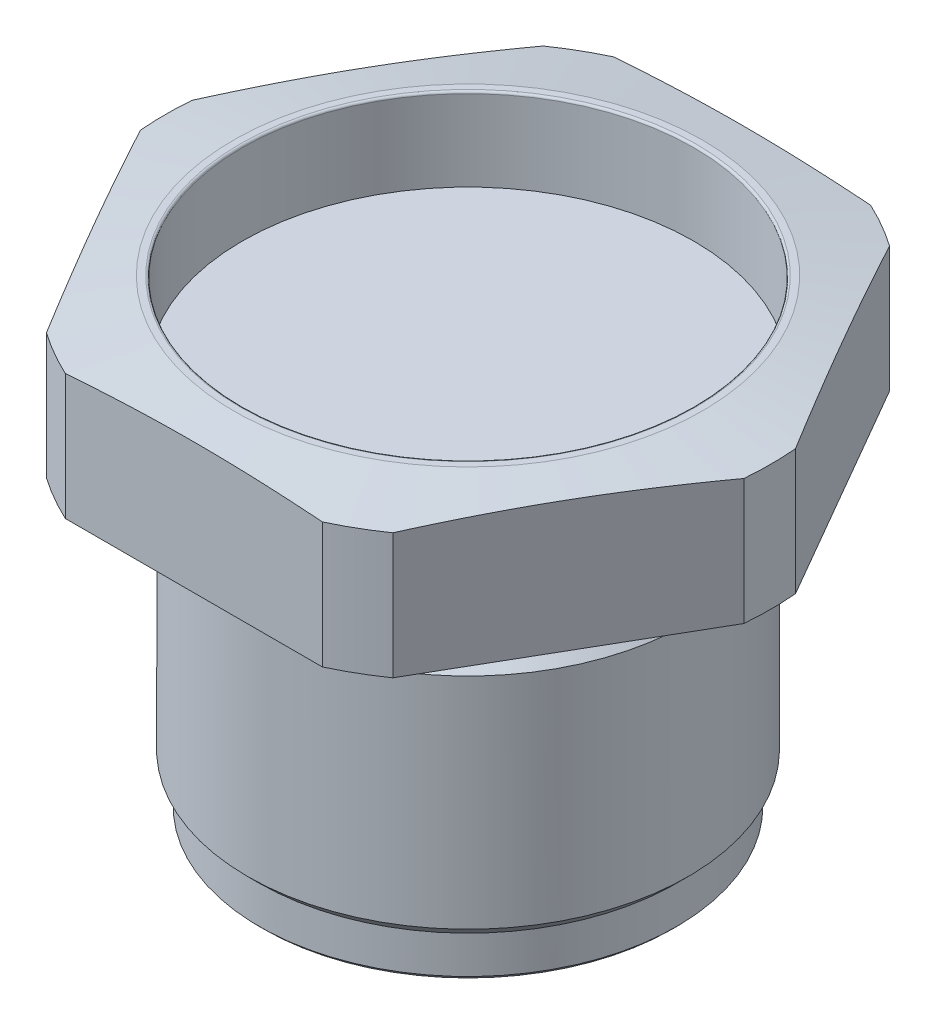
ISO-10303-21;
HEADER;
FILE_DESCRIPTION(('STEP AP214'),'2;1');
FILE_NAME('part.step','',(''),(''),'','','');
FILE_SCHEMA(('AUTOMOTIVE_DESIGN { 1 0 10303 214 1 1 1 1 }'));
ENDSEC;
DATA;
#1=APPLICATION_CONTEXT('core data for automotive mechanical design processes');
#2=APPLICATION_PROTOCOL_DEFINITION('international standard','automotive_design',2000,#1);
#3=PRODUCT_CONTEXT('',#1,'mechanical');
#4=PRODUCT('Part','Part','',(#3));
#5=PRODUCT_RELATED_PRODUCT_CATEGORY('part','',(#4));
#6=PRODUCT_DEFINITION_FORMATION('','',#4);
#7=PRODUCT_DEFINITION_CONTEXT('part definition',#1,'design');
#8=PRODUCT_DEFINITION('design','',#6,#7);
#9=PRODUCT_DEFINITION_SHAPE('','',#8);
#10=(LENGTH_UNIT() NAMED_UNIT(*) SI_UNIT(.MILLI.,.METRE.));
#11=(NAMED_UNIT(*) PLANE_ANGLE_UNIT() SI_UNIT($,.RADIAN.));
#12=(NAMED_UNIT(*) SI_UNIT($,.STERADIAN.) SOLID_ANGLE_UNIT());
#13=UNCERTAINTY_MEASURE_WITH_UNIT(LENGTH_MEASURE(1.E-05),#10,'distance_accuracy_value','');
#14=(GEOMETRIC_REPRESENTATION_CONTEXT(3) GLOBAL_UNCERTAINTY_ASSIGNED_CONTEXT((#13)) GLOBAL_UNIT_ASSIGNED_CONTEXT((#10,
#11,#12)) REPRESENTATION_CONTEXT('',''));
#15=CARTESIAN_POINT('',(0.,0.,0.));
#16=DIRECTION('',(0.,0.,1.));
#17=DIRECTION('',(1.,0.,0.));
#18=AXIS2_PLACEMENT_3D('',#15,#16,#17);
#19=CARTESIAN_POINT('',(24.0500027,-37.6428,0.));
#20=DIRECTION('',(0.,-1.,0.));
#21=DIRECTION('',(0.,0.,-1.));
#22=AXIS2_PLACEMENT_3D('',#19,#20,#21);
#23=PLANE('',#22);
#24=CARTESIAN_POINT('',(0.,-37.6428,0.));
#25=DIRECTION('',(0.,-1.,0.));
#26=DIRECTION('',(0.,0.,-1.));
#27=AXIS2_PLACEMENT_3D('',#24,#25,#26);
#28=CIRCLE('',#27,22.1334044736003);
#29=CARTESIAN_POINT('',(0.,-37.6428,-22.1334044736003));
#30=VERTEX_POINT('',#29);
#31=EDGE_CURVE('E12',#30,#30,#28,.T.);
#32=ORIENTED_EDGE('',*,*,#31,.F.);
#33=EDGE_LOOP('',(#32));
#34=FACE_BOUND('',#33,.T.);
#35=CARTESIAN_POINT('',(0.,-37.6428,0.));
#36=DIRECTION('',(0.,-1.,0.));
#37=DIRECTION('',(0.,0.,-1.));
#38=AXIS2_PLACEMENT_3D('',#35,#36,#37);
#39=CIRCLE('',#38,23.55000494);
#40=CARTESIAN_POINT('',(0.,-37.6428,-23.55000494));
#41=VERTEX_POINT('',#40);
#42=EDGE_CURVE('E184',#41,#41,#39,.T.);
#43=ORIENTED_EDGE('',*,*,#42,.T.);
#44=EDGE_LOOP('',(#43));
#45=FACE_BOUND('',#44,.T.);
#46=ADVANCED_FACE('F35',(#34,#45),#23,.T.);
#47=CARTESIAN_POINT('',(0.,-8.96894233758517,0.));
#48=DIRECTION('',(0.,-1.,0.));
#49=DIRECTION('',(0.,0.,-1.));
#50=AXIS2_PLACEMENT_3D('',#47,#48,#49);
#51=CYLINDRICAL_SURFACE('',#50,24.0500027);
#52=CARTESIAN_POINT('',(0.,-0.508,0.));
#53=DIRECTION('',(0.,-1.,0.));
#54=DIRECTION('',(0.,0.,-1.));
#55=AXIS2_PLACEMENT_3D('',#52,#53,#54);
#56=CIRCLE('',#55,24.0500027);
#57=CARTESIAN_POINT('',(0.,-0.508,-24.0500027));
#58=VERTEX_POINT('',#57);
#59=EDGE_CURVE('E201',#58,#58,#56,.T.);
#60=ORIENTED_EDGE('',*,*,#59,.T.);
#61=EDGE_LOOP('',(#60));
#62=FACE_BOUND('',#61,.T.);
#63=CARTESIAN_POINT('',(0.,-4.826,0.));
#64=DIRECTION('',(0.,-1.,0.));
#65=DIRECTION('',(0.,0.,-1.));
#66=AXIS2_PLACEMENT_3D('',#63,#64,#65);
#67=CIRCLE('',#66,24.0500027);
#68=CARTESIAN_POINT('',(0.,-4.826,-24.0500027));
#69=VERTEX_POINT('',#68);
#70=EDGE_CURVE('E198',#69,#69,#67,.T.);
#71=ORIENTED_EDGE('',*,*,#70,.F.);
#72=EDGE_LOOP('',(#71));
#73=FACE_BOUND('',#72,.T.);
#74=ADVANCED_FACE('F213',(#62,#73),#51,.T.);
#75=CARTESIAN_POINT('',(0.,14.4866013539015,0.));
#76=DIRECTION('',(0.,-1.,0.));
#77=DIRECTION('',(0.,0.,-1.));
#78=AXIS2_PLACEMENT_3D('',#75,#76,#77);
#79=CONICAL_SURFACE('',#78,34.925,1.39626340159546);
#80=CARTESIAN_POINT('',(0.,15.875,0.));
#81=DIRECTION('',(0.,-1.,0.));
#82=DIRECTION('',(0.,0.,-1.));
#83=AXIS2_PLACEMENT_3D('',#80,#81,#82);
#84=CIRCLE('',#83,27.051);
#85=CARTESIAN_POINT('',(0.,15.875,-27.051));
#86=VERTEX_POINT('',#85);
#87=EDGE_CURVE('E160',#86,#86,#84,.T.);
#88=ORIENTED_EDGE('',*,*,#87,.T.);
#89=EDGE_LOOP('',(#88));
#90=FACE_BOUND('',#89,.T.);
#91=CARTESIAN_POINT('',(0.,14.4866013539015,0.));
#92=DIRECTION('',(0.,-1.,0.));
#93=DIRECTION('',(0.,0.,-1.));
#94=AXIS2_PLACEMENT_3D('',#91,#92,#93);
#95=CIRCLE('',#94,34.925);
#96=CARTESIAN_POINT('',(-34.798161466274,14.4866013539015,2.97381633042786));
#97=VERTEX_POINT('',#96);
#98=CARTESIAN_POINT('',(-34.7981614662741,14.4866013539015,-2.97381633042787));
#99=VERTEX_POINT('',#98);
#100=EDGE_CURVE('E378',#97,#99,#95,.T.);
#101=ORIENTED_EDGE('',*,*,#100,.F.);
#102=CARTESIAN_POINT('',(-34.7994975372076,14.4864013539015,2.97150218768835));
#103=CARTESIAN_POINT('',(-34.490945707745,14.5325933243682,3.50592963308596));
#104=CARTESIAN_POINT('',(-34.1823063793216,14.5764325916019,4.04050863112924));
#105=CARTESIAN_POINT('',(-33.5648562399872,14.6590851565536,5.10996364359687));
#106=CARTESIAN_POINT('',(-33.2560454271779,14.6978983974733,5.64483966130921));
#107=CARTESIAN_POINT('',(-32.3293298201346,14.8063216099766,7.24995817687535));
#108=CARTESIAN_POINT('',(-31.7111834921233,14.8679087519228,8.32061902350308));
#109=CARTESIAN_POINT('',(-30.4753697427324,14.9673711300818,10.4611112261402));
#110=CARTESIAN_POINT('',(-29.8577030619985,15.0052829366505,11.5309412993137));
#111=CARTESIAN_POINT('',(-28.6221313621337,15.056013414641,13.6710142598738));
#112=CARTESIAN_POINT('',(-28.0042263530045,15.0688330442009,14.7412571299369));
#113=CARTESIAN_POINT('',(-26.7684163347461,15.0688330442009,16.8817428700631));
#114=CARTESIAN_POINT('',(-26.1505113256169,15.056013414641,17.9519857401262));
#115=CARTESIAN_POINT('',(-24.9149396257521,15.0052829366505,20.0920587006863));
#116=CARTESIAN_POINT('',(-24.2972729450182,14.9673711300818,21.1618887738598));
#117=CARTESIAN_POINT('',(-23.0614591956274,14.8679087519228,23.3023809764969));
#118=CARTESIAN_POINT('',(-22.4433128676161,14.8063216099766,24.3730418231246));
#119=CARTESIAN_POINT('',(-21.5165972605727,14.6978983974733,25.9781603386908));
#120=CARTESIAN_POINT('',(-21.2077864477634,14.6590851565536,26.5130363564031));
#121=CARTESIAN_POINT('',(-20.590336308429,14.5764325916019,27.5824913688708));
#122=CARTESIAN_POINT('',(-20.2816969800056,14.5325933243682,28.117070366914));
#123=CARTESIAN_POINT('',(-19.973145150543,14.4864013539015,28.6514978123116));
#124=B_SPLINE_CURVE_WITH_KNOTS('',3,(#102,#103,#104,#105,#106,#107,#108,#109,#110,#111,#112,
#113,#114,#115,#116,#117,#118,#119,#120,#121,#122,#123),.UNSPECIFIED.,.F.,.F.,(4,2,2,2,2,2,2,2,
2,2,4),(0.,1.85648195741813,3.71298489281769,7.42624125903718,11.1337476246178,14.8411124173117,
18.5484772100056,22.2559835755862,25.9692399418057,27.8257428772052,29.6822248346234),.UNSPECIFIED.);
#125=CARTESIAN_POINT('',(-19.9744812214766,14.4866013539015,28.6491836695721));
#126=VERTEX_POINT('',#125);
#127=EDGE_CURVE('E335',#97,#126,#124,.T.);
#128=ORIENTED_EDGE('',*,*,#127,.T.);
#129=CARTESIAN_POINT('',(-14.8236802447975,14.4866013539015,31.623));
#130=VERTEX_POINT('',#129);
#131=EDGE_CURVE('E178',#130,#126,#95,.T.);
#132=ORIENTED_EDGE('',*,*,#131,.F.);
#133=CARTESIAN_POINT('',(-48.1567000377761,10.4863639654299,31.623));
#134=CARTESIAN_POINT('',(-47.4393926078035,10.5920854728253,31.623));
#135=CARTESIAN_POINT('',(-46.7219832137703,10.6971147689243,31.623));
#136=CARTESIAN_POINT('',(-45.2869404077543,10.9056390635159,31.623));
#137=CARTESIAN_POINT('',(-44.569306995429,11.0091340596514,31.623));
#138=CARTESIAN_POINT('',(-42.4160180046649,11.3170960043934,31.623));
#139=CARTESIAN_POINT('',(-40.9799995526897,11.5190360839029,31.623));
#140=CARTESIAN_POINT('',(-38.1062127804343,11.9147802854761,31.623));
#141=CARTESIAN_POINT('',(-36.6684439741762,12.1085808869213,31.623));
#142=CARTESIAN_POINT('',(-33.7915811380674,12.4860790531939,31.623));
#143=CARTESIAN_POINT('',(-32.3524871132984,12.6697766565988,31.623));
#144=CARTESIAN_POINT('',(-29.4776046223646,13.0241287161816,31.623));
#145=CARTESIAN_POINT('',(-28.0418213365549,13.1948249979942,31.623));
#146=CARTESIAN_POINT('',(-25.168512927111,13.5209937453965,31.623));
#147=CARTESIAN_POINT('',(-23.7309878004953,13.6764661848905,31.623));
#148=CARTESIAN_POINT('',(-20.8541177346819,13.968739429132,31.623));
#149=CARTESIAN_POINT('',(-19.4147729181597,14.1055414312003,31.623));
#150=CARTESIAN_POINT('',(-16.5340924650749,14.3565373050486,31.623));
#151=CARTESIAN_POINT('',(-15.0927568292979,14.4707311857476,31.623));
#152=CARTESIAN_POINT('',(-12.2014034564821,14.6727749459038,31.623));
#153=CARTESIAN_POINT('',(-10.7513767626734,14.760498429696,31.623));
#154=CARTESIAN_POINT('',(-7.84976297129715,14.904850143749,31.623));
#155=CARTESIAN_POINT('',(-6.39817588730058,14.9614786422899,31.623));
#156=CARTESIAN_POINT('',(-3.49431685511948,15.0405951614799,31.623));
#157=CARTESIAN_POINT('',(-2.04204507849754,15.0630893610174,31.623));
#158=CARTESIAN_POINT('',(0.862616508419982,15.0726378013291,31.623));
#159=CARTESIAN_POINT('',(2.31500631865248,15.0596920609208,31.623));
#160=CARTESIAN_POINT('',(5.22133074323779,14.9990802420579,31.623));
#161=CARTESIAN_POINT('',(6.67526419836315,14.9513596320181,31.623));
#162=CARTESIAN_POINT('',(9.58170754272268,14.8237856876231,31.623));
#163=CARTESIAN_POINT('',(11.0342174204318,14.7439320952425,31.623));
#164=CARTESIAN_POINT('',(13.9377497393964,14.5559219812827,31.623));
#165=CARTESIAN_POINT('',(15.3887717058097,14.4477582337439,31.623));
#166=CARTESIAN_POINT('',(18.2888053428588,14.2074244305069,31.623));
#167=CARTESIAN_POINT('',(19.7378170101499,14.0752543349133,31.623));
#168=CARTESIAN_POINT('',(22.5560206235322,13.7986726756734,31.623));
#169=CARTESIAN_POINT('',(23.9253156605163,13.6553012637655,31.623));
#170=CARTESIAN_POINT('',(26.6622944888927,13.3538554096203,31.623));
#171=CARTESIAN_POINT('',(28.029978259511,13.1957807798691,31.623));
#172=CARTESIAN_POINT('',(30.7639552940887,12.8675564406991,31.623));
#173=CARTESIAN_POINT('',(32.1302484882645,12.6974061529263,31.623));
#174=CARTESIAN_POINT('',(34.861555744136,12.3472108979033,31.623));
#175=CARTESIAN_POINT('',(36.2265698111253,12.167165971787,31.623));
#176=CARTESIAN_POINT('',(38.9557031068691,11.7989174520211,31.623));
#177=CARTESIAN_POINT('',(40.3198221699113,11.6107126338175,31.623));
#178=CARTESIAN_POINT('',(43.0471163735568,11.2275913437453,31.623));
#179=CARTESIAN_POINT('',(44.4102915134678,11.0326748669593,31.623));
#180=CARTESIAN_POINT('',(47.1357929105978,10.6372788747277,31.623));
#181=CARTESIAN_POINT('',(48.4981191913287,10.4367995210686,31.623));
#182=CARTESIAN_POINT('',(51.222077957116,10.0311913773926,31.623));
#183=CARTESIAN_POINT('',(52.5837104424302,9.82606258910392,31.623));
#184=CARTESIAN_POINT('',(55.3005625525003,9.4127836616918,31.623));
#185=CARTESIAN_POINT('',(56.6557847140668,9.20465018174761,31.623));
#186=CARTESIAN_POINT('',(59.3657211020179,8.78510037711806,31.623));
#187=CARTESIAN_POINT('',(60.720435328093,8.57368405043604,31.623));
#188=CARTESIAN_POINT('',(64.7839427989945,7.93525909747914,31.623));
#189=CARTESIAN_POINT('',(67.492080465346,7.50407761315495,31.623));
#190=CARTESIAN_POINT('',(72.9053414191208,6.6337902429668,31.623));
#191=CARTESIAN_POINT('',(75.6104655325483,6.19468948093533,31.623));
#192=CARTESIAN_POINT('',(79.6673673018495,5.53137848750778,31.623));
#193=CARTESIAN_POINT('',(81.0195267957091,5.30949990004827,31.623));
#194=CARTESIAN_POINT('',(83.7236190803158,4.86436973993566,31.623));
#195=CARTESIAN_POINT('',(85.0755518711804,4.6411181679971,31.623));
#196=CARTESIAN_POINT('',(86.4273859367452,4.41727067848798,31.623));
#197=B_SPLINE_CURVE_WITH_KNOTS('',3,(#133,#134,#135,#136,#137,#138,#139,#140,#141,#142,#143,
#144,#145,#146,#147,#148,#149,#150,#151,#152,#153,#154,#155,#156,#157,#158,#159,#160,#161,#162,
#163,#164,#165,#166,#167,#168,#169,#170,#171,#172,#173,#174,#175,#176,#177,#178,#179,#180,#181,
#182,#183,#184,#185,#186,#187,#188,#189,#190,#191,#192,#193,#194,#195,#196),.UNSPECIFIED.,.F.,
.F.,(4,2,2,2,2,2,2,2,2,2,2,2,2,2,2,2,2,2,2,2,2,2,2,2,2,2,2,2,2,2,2,4),(0.,2.17516898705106,
4.35034131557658,8.70076445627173,13.0530503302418,17.4053195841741,21.7429377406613,
26.0805633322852,30.4179106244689,34.7552562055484,39.1129962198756,43.4706986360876,
47.8276121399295,52.184523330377,56.5482814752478,60.9120746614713,65.276982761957,
69.6418981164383,73.7721456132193,77.9024457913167,82.032943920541,86.1634248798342,
90.294527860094,94.4256338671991,98.5566198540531,102.687604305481,106.800933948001,
110.914266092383,119.140992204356,127.362574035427,131.473301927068,135.584027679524),.UNSPECIFIED.);
#198=CARTESIAN_POINT('',(14.8236802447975,14.4866013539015,31.623));
#199=VERTEX_POINT('',#198);
#200=EDGE_CURVE('E341',#130,#199,#197,.T.);
#201=ORIENTED_EDGE('',*,*,#200,.T.);
#202=CARTESIAN_POINT('',(19.9744812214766,14.4866013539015,28.6491836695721));
#203=VERTEX_POINT('',#202);
#204=EDGE_CURVE('E381',#203,#199,#95,.T.);
#205=ORIENTED_EDGE('',*,*,#204,.F.);
#206=CARTESIAN_POINT('',(19.973145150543,14.4864013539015,28.6514978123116));
#207=CARTESIAN_POINT('',(20.2816969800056,14.5325933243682,28.117070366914));
#208=CARTESIAN_POINT('',(20.590336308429,14.5764325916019,27.5824913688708));
#209=CARTESIAN_POINT('',(21.2077864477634,14.6590851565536,26.5130363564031));
#210=CARTESIAN_POINT('',(21.5165972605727,14.6978983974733,25.9781603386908));
#211=CARTESIAN_POINT('',(22.4433128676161,14.8063216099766,24.3730418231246));
#212=CARTESIAN_POINT('',(23.0614591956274,14.8679087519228,23.3023809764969));
#213=CARTESIAN_POINT('',(24.2972729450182,14.9673711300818,21.1618887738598));
#214=CARTESIAN_POINT('',(24.9149396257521,15.0052829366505,20.0920587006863));
#215=CARTESIAN_POINT('',(26.1505113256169,15.056013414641,17.9519857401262));
#216=CARTESIAN_POINT('',(26.7684163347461,15.0688330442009,16.8817428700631));
#217=CARTESIAN_POINT('',(28.0042263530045,15.0688330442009,14.7412571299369));
#218=CARTESIAN_POINT('',(28.6221313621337,15.056013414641,13.6710142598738));
#219=CARTESIAN_POINT('',(29.8577030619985,15.0052829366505,11.5309412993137));
#220=CARTESIAN_POINT('',(30.4753697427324,14.9673711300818,10.4611112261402));
#221=CARTESIAN_POINT('',(31.7111834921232,14.8679087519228,8.32061902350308));
#222=CARTESIAN_POINT('',(32.3293298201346,14.8063216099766,7.24995817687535));
#223=CARTESIAN_POINT('',(33.2560454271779,14.6978983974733,5.64483966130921));
#224=CARTESIAN_POINT('',(33.5648562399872,14.6590851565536,5.10996364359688));
#225=CARTESIAN_POINT('',(34.1823063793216,14.5764325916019,4.04050863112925));
#226=CARTESIAN_POINT('',(34.490945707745,14.5325933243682,3.50592963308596));
#227=CARTESIAN_POINT('',(34.7994975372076,14.4864013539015,2.97150218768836));
#228=B_SPLINE_CURVE_WITH_KNOTS('',3,(#206,#207,#208,#209,#210,#211,#212,#213,#214,#215,#216,
#217,#218,#219,#220,#221,#222,#223,#224,#225,#226,#227),.UNSPECIFIED.,.F.,.F.,(4,2,2,2,2,2,2,2,
2,2,4),(0.,1.85648195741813,3.71298489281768,7.42624125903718,11.1337476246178,14.8411124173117,
18.5484772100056,22.2559835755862,25.9692399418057,27.8257428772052,29.6822248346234),.UNSPECIFIED.);
#229=CARTESIAN_POINT('',(34.7981614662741,14.4866013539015,2.97381633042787));
#230=VERTEX_POINT('',#229);
#231=EDGE_CURVE('E348',#203,#230,#228,.T.);
#232=ORIENTED_EDGE('',*,*,#231,.T.);
#233=CARTESIAN_POINT('',(34.798161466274,14.4866013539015,-2.97381633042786));
#234=VERTEX_POINT('',#233);
#235=EDGE_CURVE('E150',#234,#230,#95,.T.);
#236=ORIENTED_EDGE('',*,*,#235,.F.);
#237=CARTESIAN_POINT('',(34.7994975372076,14.4864013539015,-2.97150218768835));
#238=CARTESIAN_POINT('',(34.490945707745,14.5325933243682,-3.50592963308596));
#239=CARTESIAN_POINT('',(34.1823063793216,14.5764325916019,-4.04050863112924));
#240=CARTESIAN_POINT('',(33.5648562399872,14.6590851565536,-5.10996364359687));
#241=CARTESIAN_POINT('',(33.2560454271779,14.6978983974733,-5.64483966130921));
#242=CARTESIAN_POINT('',(32.3293298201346,14.8063216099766,-7.24995817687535));
#243=CARTESIAN_POINT('',(31.7111834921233,14.8679087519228,-8.32061902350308));
#244=CARTESIAN_POINT('',(30.4753697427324,14.9673711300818,-10.4611112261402));
#245=CARTESIAN_POINT('',(29.8577030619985,15.0052829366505,-11.5309412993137));
#246=CARTESIAN_POINT('',(28.6221313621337,15.056013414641,-13.6710142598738));
#247=CARTESIAN_POINT('',(28.0042263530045,15.0688330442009,-14.7412571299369));
#248=CARTESIAN_POINT('',(26.7684163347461,15.0688330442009,-16.8817428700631));
#249=CARTESIAN_POINT('',(26.1505113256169,15.056013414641,-17.9519857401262));
#250=CARTESIAN_POINT('',(24.9149396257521,15.0052829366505,-20.0920587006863));
#251=CARTESIAN_POINT('',(24.2972729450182,14.9673711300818,-21.1618887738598));
#252=CARTESIAN_POINT('',(23.0614591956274,14.8679087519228,-23.3023809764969));
#253=CARTESIAN_POINT('',(22.4433128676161,14.8063216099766,-24.3730418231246));
#254=CARTESIAN_POINT('',(21.5165972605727,14.6978983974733,-25.9781603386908));
#255=CARTESIAN_POINT('',(21.2077864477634,14.6590851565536,-26.5130363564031));
#256=CARTESIAN_POINT('',(20.590336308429,14.5764325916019,-27.5824913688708));
#257=CARTESIAN_POINT('',(20.2816969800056,14.5325933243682,-28.117070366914));
#258=CARTESIAN_POINT('',(19.973145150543,14.4864013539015,-28.6514978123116));
#259=B_SPLINE_CURVE_WITH_KNOTS('',3,(#237,#238,#239,#240,#241,#242,#243,#244,#245,#246,#247,
#248,#249,#250,#251,#252,#253,#254,#255,#256,#257,#258),.UNSPECIFIED.,.F.,.F.,(4,2,2,2,2,2,2,2,
2,2,4),(0.,1.85648195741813,3.71298489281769,7.42624125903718,11.1337476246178,14.8411124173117,
18.5484772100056,22.2559835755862,25.9692399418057,27.8257428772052,29.6822248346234),.UNSPECIFIED.);
#260=CARTESIAN_POINT('',(19.9744812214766,14.4866013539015,-28.6491836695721));
#261=VERTEX_POINT('',#260);
#262=EDGE_CURVE('E365',#234,#261,#259,.T.);
#263=ORIENTED_EDGE('',*,*,#262,.T.);
#264=CARTESIAN_POINT('',(14.8236802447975,14.4866013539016,-31.623));
#265=VERTEX_POINT('',#264);
#266=EDGE_CURVE('E145',#265,#261,#95,.T.);
#267=ORIENTED_EDGE('',*,*,#266,.F.);
#268=CARTESIAN_POINT('',(-48.1567000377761,10.4863639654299,-31.623));
#269=CARTESIAN_POINT('',(-47.4393926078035,10.5920854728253,-31.623));
#270=CARTESIAN_POINT('',(-46.7219832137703,10.6971147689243,-31.623));
#271=CARTESIAN_POINT('',(-45.2869404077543,10.9056390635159,-31.623));
#272=CARTESIAN_POINT('',(-44.569306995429,11.0091340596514,-31.623));
#273=CARTESIAN_POINT('',(-42.4160180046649,11.3170960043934,-31.623));
#274=CARTESIAN_POINT('',(-40.9799995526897,11.5190360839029,-31.623));
#275=CARTESIAN_POINT('',(-38.1062127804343,11.9147802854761,-31.623));
#276=CARTESIAN_POINT('',(-36.6684439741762,12.1085808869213,-31.623));
#277=CARTESIAN_POINT('',(-33.7915811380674,12.4860790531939,-31.623));
#278=CARTESIAN_POINT('',(-32.3524871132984,12.6697766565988,-31.623));
#279=CARTESIAN_POINT('',(-29.4776046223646,13.0241287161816,-31.623));
#280=CARTESIAN_POINT('',(-28.0418213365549,13.1948249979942,-31.623));
#281=CARTESIAN_POINT('',(-25.168512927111,13.5209937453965,-31.623));
#282=CARTESIAN_POINT('',(-23.7309878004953,13.6764661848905,-31.623));
#283=CARTESIAN_POINT('',(-20.8541177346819,13.968739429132,-31.623));
#284=CARTESIAN_POINT('',(-19.4147729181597,14.1055414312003,-31.623));
#285=CARTESIAN_POINT('',(-16.5340924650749,14.3565373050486,-31.623));
#286=CARTESIAN_POINT('',(-15.0927568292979,14.4707311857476,-31.623));
#287=CARTESIAN_POINT('',(-12.2014034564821,14.6727749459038,-31.623));
#288=CARTESIAN_POINT('',(-10.7513767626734,14.760498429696,-31.623));
#289=CARTESIAN_POINT('',(-7.84976297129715,14.904850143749,-31.623));
#290=CARTESIAN_POINT('',(-6.39817588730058,14.9614786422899,-31.623));
#291=CARTESIAN_POINT('',(-3.49431685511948,15.0405951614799,-31.623));
#292=CARTESIAN_POINT('',(-2.04204507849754,15.0630893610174,-31.623));
#293=CARTESIAN_POINT('',(0.862616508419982,15.0726378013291,-31.623));
#294=CARTESIAN_POINT('',(2.31500631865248,15.0596920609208,-31.623));
#295=CARTESIAN_POINT('',(5.22133074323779,14.9990802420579,-31.623));
#296=CARTESIAN_POINT('',(6.67526419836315,14.9513596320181,-31.623));
#297=CARTESIAN_POINT('',(9.58170754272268,14.8237856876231,-31.623));
#298=CARTESIAN_POINT('',(11.0342174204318,14.7439320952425,-31.623));
#299=CARTESIAN_POINT('',(13.9377497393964,14.5559219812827,-31.623));
#300=CARTESIAN_POINT('',(15.3887717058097,14.4477582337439,-31.623));
#301=CARTESIAN_POINT('',(18.2888053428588,14.2074244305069,-31.623));
#302=CARTESIAN_POINT('',(19.7378170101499,14.0752543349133,-31.623));
#303=CARTESIAN_POINT('',(22.5560206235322,13.7986726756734,-31.623));
#304=CARTESIAN_POINT('',(23.9253156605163,13.6553012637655,-31.623));
#305=CARTESIAN_POINT('',(26.6622944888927,13.3538554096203,-31.623));
#306=CARTESIAN_POINT('',(28.029978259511,13.1957807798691,-31.623));
#307=CARTESIAN_POINT('',(30.7639552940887,12.8675564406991,-31.623));
#308=CARTESIAN_POINT('',(32.1302484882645,12.6974061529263,-31.623));
#309=CARTESIAN_POINT('',(34.861555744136,12.3472108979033,-31.623));
#310=CARTESIAN_POINT('',(36.2265698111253,12.167165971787,-31.623));
#311=CARTESIAN_POINT('',(38.9557031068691,11.7989174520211,-31.623));
#312=CARTESIAN_POINT('',(40.3198221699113,11.6107126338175,-31.623));
#313=CARTESIAN_POINT('',(43.0471163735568,11.2275913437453,-31.623));
#314=CARTESIAN_POINT('',(44.4102915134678,11.0326748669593,-31.623));
#315=CARTESIAN_POINT('',(47.1357929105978,10.6372788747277,-31.623));
#316=CARTESIAN_POINT('',(48.4981191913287,10.4367995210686,-31.623));
#317=CARTESIAN_POINT('',(51.222077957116,10.0311913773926,-31.623));
#318=CARTESIAN_POINT('',(52.5837104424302,9.82606258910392,-31.623));
#319=CARTESIAN_POINT('',(55.3005625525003,9.4127836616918,-31.623));
#320=CARTESIAN_POINT('',(56.6557847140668,9.20465018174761,-31.623));
#321=CARTESIAN_POINT('',(59.3657211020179,8.78510037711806,-31.623));
#322=CARTESIAN_POINT('',(60.720435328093,8.57368405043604,-31.623));
#323=CARTESIAN_POINT('',(64.7839427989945,7.93525909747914,-31.623));
#324=CARTESIAN_POINT('',(67.492080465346,7.50407761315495,-31.623));
#325=CARTESIAN_POINT('',(72.9053414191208,6.6337902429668,-31.623));
#326=CARTESIAN_POINT('',(75.6104655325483,6.19468948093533,-31.623));
#327=CARTESIAN_POINT('',(79.6673673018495,5.53137848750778,-31.623));
#328=CARTESIAN_POINT('',(81.0195267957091,5.30949990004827,-31.623));
#329=CARTESIAN_POINT('',(83.7236190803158,4.86436973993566,-31.623));
#330=CARTESIAN_POINT('',(85.0755518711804,4.6411181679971,-31.623));
#331=CARTESIAN_POINT('',(86.4273859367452,4.41727067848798,-31.623));
#332=B_SPLINE_CURVE_WITH_KNOTS('',3,(#268,#269,#270,#271,#272,#273,#274,#275,#276,#277,#278,
#279,#280,#281,#282,#283,#284,#285,#286,#287,#288,#289,#290,#291,#292,#293,#294,#295,#296,#297,
#298,#299,#300,#301,#302,#303,#304,#305,#306,#307,#308,#309,#310,#311,#312,#313,#314,#315,#316,
#317,#318,#319,#320,#321,#322,#323,#324,#325,#326,#327,#328,#329,#330,#331),.UNSPECIFIED.,.F.,
.F.,(4,2,2,2,2,2,2,2,2,2,2,2,2,2,2,2,2,2,2,2,2,2,2,2,2,2,2,2,2,2,2,4),(0.,2.17516898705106,
4.35034131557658,8.70076445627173,13.0530503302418,17.4053195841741,21.7429377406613,
26.0805633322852,30.4179106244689,34.7552562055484,39.1129962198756,43.4706986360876,
47.8276121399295,52.184523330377,56.5482814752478,60.9120746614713,65.276982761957,
69.6418981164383,73.7721456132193,77.9024457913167,82.032943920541,86.1634248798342,
90.294527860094,94.4256338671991,98.5566198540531,102.687604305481,106.800933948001,
110.914266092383,119.140992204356,127.362574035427,131.473301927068,135.584027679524),.UNSPECIFIED.);
#333=CARTESIAN_POINT('',(-14.8236802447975,14.4866013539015,-31.623));
#334=VERTEX_POINT('',#333);
#335=EDGE_CURVE('E314',#265,#334,#332,.F.);
#336=ORIENTED_EDGE('',*,*,#335,.T.);
#337=CARTESIAN_POINT('',(-19.9744812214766,14.4866013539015,-28.6491836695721));
#338=VERTEX_POINT('',#337);
#339=EDGE_CURVE('E152',#338,#334,#95,.T.);
#340=ORIENTED_EDGE('',*,*,#339,.F.);
#341=CARTESIAN_POINT('',(-19.973145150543,14.4864013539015,-28.6514978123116));
#342=CARTESIAN_POINT('',(-20.2816969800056,14.5325933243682,-28.117070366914));
#343=CARTESIAN_POINT('',(-20.590336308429,14.5764325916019,-27.5824913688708));
#344=CARTESIAN_POINT('',(-21.2077864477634,14.6590851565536,-26.5130363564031));
#345=CARTESIAN_POINT('',(-21.5165972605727,14.6978983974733,-25.9781603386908));
#346=CARTESIAN_POINT('',(-22.4433128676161,14.8063216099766,-24.3730418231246));
#347=CARTESIAN_POINT('',(-23.0614591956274,14.8679087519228,-23.3023809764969));
#348=CARTESIAN_POINT('',(-24.2972729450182,14.9673711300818,-21.1618887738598));
#349=CARTESIAN_POINT('',(-24.9149396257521,15.0052829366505,-20.0920587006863));
#350=CARTESIAN_POINT('',(-26.1505113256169,15.056013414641,-17.9519857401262));
#351=CARTESIAN_POINT('',(-26.7684163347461,15.0688330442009,-16.8817428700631));
#352=CARTESIAN_POINT('',(-28.0042263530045,15.0688330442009,-14.7412571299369));
#353=CARTESIAN_POINT('',(-28.6221313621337,15.056013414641,-13.6710142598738));
#354=CARTESIAN_POINT('',(-29.8577030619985,15.0052829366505,-11.5309412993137));
#355=CARTESIAN_POINT('',(-30.4753697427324,14.9673711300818,-10.4611112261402));
#356=CARTESIAN_POINT('',(-31.7111834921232,14.8679087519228,-8.32061902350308));
#357=CARTESIAN_POINT('',(-32.3293298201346,14.8063216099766,-7.24995817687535));
#358=CARTESIAN_POINT('',(-33.2560454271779,14.6978983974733,-5.64483966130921));
#359=CARTESIAN_POINT('',(-33.5648562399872,14.6590851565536,-5.10996364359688));
#360=CARTESIAN_POINT('',(-34.1823063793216,14.5764325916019,-4.04050863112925));
#361=CARTESIAN_POINT('',(-34.490945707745,14.5325933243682,-3.50592963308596));
#362=CARTESIAN_POINT('',(-34.7994975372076,14.4864013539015,-2.97150218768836));
#363=B_SPLINE_CURVE_WITH_KNOTS('',3,(#341,#342,#343,#344,#345,#346,#347,#348,#349,#350,#351,
#352,#353,#354,#355,#356,#357,#358,#359,#360,#361,#362),.UNSPECIFIED.,.F.,.F.,(4,2,2,2,2,2,2,2,
2,2,4),(0.,1.85648195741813,3.71298489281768,7.42624125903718,11.1337476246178,14.8411124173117,
18.5484772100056,22.2559835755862,25.9692399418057,27.8257428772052,29.6822248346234),.UNSPECIFIED.);
#364=EDGE_CURVE('E125',#338,#99,#363,.T.);
#365=ORIENTED_EDGE('',*,*,#364,.T.);
#366=EDGE_LOOP('',(#101,#128,#132,#201,#205,#232,#236,#263,#267,#336,#340,#365));
#367=FACE_BOUND('',#366,.T.);
#368=ADVANCED_FACE('F216',(#90,#367),#79,.T.);
#369=CARTESIAN_POINT('',(34.925,0.,0.));
#370=DIRECTION('',(0.,-1.,0.));
#371=DIRECTION('',(0.,0.,-1.));
#372=AXIS2_PLACEMENT_3D('',#369,#370,#371);
#373=PLANE('',#372);
#374=CARTESIAN_POINT('',(0.,0.,0.));
#375=DIRECTION('',(0.,-1.,0.));
#376=DIRECTION('',(0.,0.,-1.));
#377=AXIS2_PLACEMENT_3D('',#374,#375,#376);
#378=CIRCLE('',#377,24.5580027);
#379=CARTESIAN_POINT('',(0.,0.,-24.5580027));
#380=VERTEX_POINT('',#379);
#381=EDGE_CURVE('E43',#380,#380,#378,.F.);
#382=ORIENTED_EDGE('',*,*,#381,.T.);
#383=EDGE_LOOP('',(#382));
#384=FACE_BOUND('',#383,.T.);
#385=CARTESIAN_POINT('',(0.,0.,0.));
#386=DIRECTION('',(0.,-1.,0.));
#387=DIRECTION('',(0.,0.,-1.));
#388=AXIS2_PLACEMENT_3D('',#385,#386,#387);
#389=CIRCLE('',#388,34.925);
#390=CARTESIAN_POINT('',(-14.8236802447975,0.,31.623));
#391=VERTEX_POINT('',#390);
#392=CARTESIAN_POINT('',(-19.9744812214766,0.,28.6491836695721));
#393=VERTEX_POINT('',#392);
#394=EDGE_CURVE('E148',#391,#393,#389,.T.);
#395=ORIENTED_EDGE('',*,*,#394,.T.);
#396=DIRECTION('',(-0.5,0.,-0.866025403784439));
#397=VECTOR('',#396,1.);
#398=CARTESIAN_POINT('',(-36.5150951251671,0.,0.));
#399=LINE('',#398,#397);
#400=CARTESIAN_POINT('',(-34.798161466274,0.,2.97381633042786));
#401=VERTEX_POINT('',#400);
#402=EDGE_CURVE('E142',#393,#401,#399,.T.);
#403=ORIENTED_EDGE('',*,*,#402,.T.);
#404=CARTESIAN_POINT('',(-34.7981614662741,0.,-2.97381633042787));
#405=VERTEX_POINT('',#404);
#406=EDGE_CURVE('E141',#401,#405,#389,.T.);
#407=ORIENTED_EDGE('',*,*,#406,.T.);
#408=DIRECTION('',(0.5,0.,-0.866025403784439));
#409=VECTOR('',#408,1.);
#410=CARTESIAN_POINT('',(-18.2575475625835,0.,-31.623));
#411=LINE('',#410,#409);
#412=CARTESIAN_POINT('',(-19.9744812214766,0.,-28.6491836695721));
#413=VERTEX_POINT('',#412);
#414=EDGE_CURVE('E58',#405,#413,#411,.T.);
#415=ORIENTED_EDGE('',*,*,#414,.T.);
#416=CARTESIAN_POINT('',(-14.8236802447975,0.,-31.623));
#417=VERTEX_POINT('',#416);
#418=EDGE_CURVE('E138',#413,#417,#389,.T.);
#419=ORIENTED_EDGE('',*,*,#418,.T.);
#420=DIRECTION('',(1.,0.,0.));
#421=VECTOR('',#420,1.);
#422=CARTESIAN_POINT('',(18.2575475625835,0.,-31.623));
#423=LINE('',#422,#421);
#424=CARTESIAN_POINT('',(14.8236802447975,0.,-31.623));
#425=VERTEX_POINT('',#424);
#426=EDGE_CURVE('E50',#417,#425,#423,.T.);
#427=ORIENTED_EDGE('',*,*,#426,.T.);
#428=CARTESIAN_POINT('',(19.9744812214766,0.,-28.6491836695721));
#429=VERTEX_POINT('',#428);
#430=EDGE_CURVE('E147',#425,#429,#389,.T.);
#431=ORIENTED_EDGE('',*,*,#430,.T.);
#432=DIRECTION('',(0.5,0.,0.866025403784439));
#433=VECTOR('',#432,1.);
#434=CARTESIAN_POINT('',(36.5150951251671,0.,0.));
#435=LINE('',#434,#433);
#436=CARTESIAN_POINT('',(34.798161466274,0.,-2.97381633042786));
#437=VERTEX_POINT('',#436);
#438=EDGE_CURVE('E302',#429,#437,#435,.T.);
#439=ORIENTED_EDGE('',*,*,#438,.T.);
#440=CARTESIAN_POINT('',(34.7981614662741,0.,2.97381633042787));
#441=VERTEX_POINT('',#440);
#442=EDGE_CURVE('E156',#437,#441,#389,.T.);
#443=ORIENTED_EDGE('',*,*,#442,.T.);
#444=DIRECTION('',(-0.5,0.,0.866025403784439));
#445=VECTOR('',#444,1.);
#446=CARTESIAN_POINT('',(18.2575475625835,0.,31.623));
#447=LINE('',#446,#445);
#448=CARTESIAN_POINT('',(19.9744812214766,0.,28.6491836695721));
#449=VERTEX_POINT('',#448);
#450=EDGE_CURVE('E304',#441,#449,#447,.T.);
#451=ORIENTED_EDGE('',*,*,#450,.T.);
#452=CARTESIAN_POINT('',(14.8236802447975,0.,31.623));
#453=VERTEX_POINT('',#452);
#454=EDGE_CURVE('E162',#449,#453,#389,.T.);
#455=ORIENTED_EDGE('',*,*,#454,.T.);
#456=DIRECTION('',(-1.,0.,0.));
#457=VECTOR('',#456,1.);
#458=CARTESIAN_POINT('',(-18.2575475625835,0.,31.623));
#459=LINE('',#458,#457);
#460=EDGE_CURVE('E169',#453,#391,#459,.T.);
#461=ORIENTED_EDGE('',*,*,#460,.T.);
#462=EDGE_LOOP('',(#395,#403,#407,#415,#419,#427,#431,#439,#443,#451,#455,#461));
#463=FACE_BOUND('',#462,.T.);
#464=ADVANCED_FACE('F137',(#384,#463),#373,.T.);
#465=CARTESIAN_POINT('',(0.,-8.96894233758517,0.));
#466=DIRECTION('',(0.,-1.,0.));
#467=DIRECTION('',(0.,0.,-1.));
#468=AXIS2_PLACEMENT_3D('',#465,#466,#467);
#469=CYLINDRICAL_SURFACE('',#468,34.925);
#470=ORIENTED_EDGE('',*,*,#406,.F.);
#471=DIRECTION('',(0.,-1.,0.));
#472=VECTOR('',#471,1.);
#473=CARTESIAN_POINT('',(-34.7981614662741,-8.96894233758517,2.97381633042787));
#474=LINE('',#473,#472);
#475=EDGE_CURVE('E181',#401,#97,#474,.F.);
#476=ORIENTED_EDGE('',*,*,#475,.T.);
#477=ORIENTED_EDGE('',*,*,#100,.T.);
#478=DIRECTION('',(0.,-1.,0.));
#479=VECTOR('',#478,1.);
#480=CARTESIAN_POINT('',(-34.7981614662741,-8.96894233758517,-2.97381633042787));
#481=LINE('',#480,#479);
#482=EDGE_CURVE('E131',#99,#405,#481,.T.);
#483=ORIENTED_EDGE('',*,*,#482,.T.);
#484=EDGE_LOOP('',(#470,#476,#477,#483));
#485=FACE_BOUND('',#484,.T.);
#486=ADVANCED_FACE('F332',(#485),#469,.T.);
#487=ORIENTED_EDGE('',*,*,#131,.T.);
#488=DIRECTION('',(0.,-1.,0.));
#489=VECTOR('',#488,1.);
#490=CARTESIAN_POINT('',(-19.9744812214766,-8.96894233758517,28.6491836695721));
#491=LINE('',#490,#489);
#492=EDGE_CURVE('E177',#126,#393,#491,.T.);
#493=ORIENTED_EDGE('',*,*,#492,.T.);
#494=ORIENTED_EDGE('',*,*,#394,.F.);
#495=DIRECTION('',(0.,-1.,0.));
#496=VECTOR('',#495,1.);
#497=CARTESIAN_POINT('',(-14.8236802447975,-8.96894233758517,31.623));
#498=LINE('',#497,#496);
#499=EDGE_CURVE('E175',#391,#130,#498,.F.);
#500=ORIENTED_EDGE('',*,*,#499,.T.);
#501=EDGE_LOOP('',(#487,#493,#494,#500));
#502=FACE_BOUND('',#501,.T.);
#503=ADVANCED_FACE('F174',(#502),#469,.T.);
#504=ORIENTED_EDGE('',*,*,#204,.T.);
#505=DIRECTION('',(0.,-1.,0.));
#506=VECTOR('',#505,1.);
#507=CARTESIAN_POINT('',(14.8236802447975,-8.96894233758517,31.623));
#508=LINE('',#507,#506);
#509=EDGE_CURVE('E186',#199,#453,#508,.T.);
#510=ORIENTED_EDGE('',*,*,#509,.T.);
#511=ORIENTED_EDGE('',*,*,#454,.F.);
#512=DIRECTION('',(0.,-1.,0.));
#513=VECTOR('',#512,1.);
#514=CARTESIAN_POINT('',(19.9744812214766,-8.96894233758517,28.6491836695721));
#515=LINE('',#514,#513);
#516=EDGE_CURVE('E394',#449,#203,#515,.F.);
#517=ORIENTED_EDGE('',*,*,#516,.T.);
#518=EDGE_LOOP('',(#504,#510,#511,#517));
#519=FACE_BOUND('',#518,.T.);
#520=ADVANCED_FACE('F395',(#519),#469,.T.);
#521=ORIENTED_EDGE('',*,*,#235,.T.);
#522=DIRECTION('',(0.,-1.,0.));
#523=VECTOR('',#522,1.);
#524=CARTESIAN_POINT('',(34.7981614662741,-8.96894233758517,2.97381633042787));
#525=LINE('',#524,#523);
#526=EDGE_CURVE('E392',#230,#441,#525,.T.);
#527=ORIENTED_EDGE('',*,*,#526,.T.);
#528=ORIENTED_EDGE('',*,*,#442,.F.);
#529=DIRECTION('',(0.,-1.,0.));
#530=VECTOR('',#529,1.);
#531=CARTESIAN_POINT('',(34.7981614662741,-8.96894233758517,-2.97381633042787));
#532=LINE('',#531,#530);
#533=EDGE_CURVE('E393',#437,#234,#532,.F.);
#534=ORIENTED_EDGE('',*,*,#533,.T.);
#535=EDGE_LOOP('',(#521,#527,#528,#534));
#536=FACE_BOUND('',#535,.T.);
#537=ADVANCED_FACE('F391',(#536),#469,.T.);
#538=ORIENTED_EDGE('',*,*,#266,.T.);
#539=DIRECTION('',(0.,-1.,0.));
#540=VECTOR('',#539,1.);
#541=CARTESIAN_POINT('',(19.9744812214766,-8.96894233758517,-28.6491836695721));
#542=LINE('',#541,#540);
#543=EDGE_CURVE('E400',#261,#429,#542,.T.);
#544=ORIENTED_EDGE('',*,*,#543,.T.);
#545=ORIENTED_EDGE('',*,*,#430,.F.);
#546=DIRECTION('',(0.,-1.,0.));
#547=VECTOR('',#546,1.);
#548=CARTESIAN_POINT('',(14.8236802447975,-8.96894233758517,-31.623));
#549=LINE('',#548,#547);
#550=EDGE_CURVE('E403',#425,#265,#549,.F.);
#551=ORIENTED_EDGE('',*,*,#550,.T.);
#552=EDGE_LOOP('',(#538,#544,#545,#551));
#553=FACE_BOUND('',#552,.T.);
#554=ADVANCED_FACE('F428',(#553),#469,.T.);
#555=ORIENTED_EDGE('',*,*,#339,.T.);
#556=DIRECTION('',(0.,-1.,0.));
#557=VECTOR('',#556,1.);
#558=CARTESIAN_POINT('',(-14.8236802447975,-8.96894233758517,-31.623));
#559=LINE('',#558,#557);
#560=EDGE_CURVE('E130',#334,#417,#559,.T.);
#561=ORIENTED_EDGE('',*,*,#560,.T.);
#562=ORIENTED_EDGE('',*,*,#418,.F.);
#563=DIRECTION('',(0.,-1.,0.));
#564=VECTOR('',#563,1.);
#565=CARTESIAN_POINT('',(-19.9744812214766,-8.96894233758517,-28.6491836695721));
#566=LINE('',#565,#564);
#567=EDGE_CURVE('E122',#413,#338,#566,.F.);
#568=ORIENTED_EDGE('',*,*,#567,.T.);
#569=EDGE_LOOP('',(#555,#561,#562,#568));
#570=FACE_BOUND('',#569,.T.);
#571=ADVANCED_FACE('F144',(#570),#469,.T.);
#572=CARTESIAN_POINT('',(26.035,15.875,0.));
#573=DIRECTION('',(0.,1.,0.));
#574=DIRECTION('',(0.,0.,1.));
#575=AXIS2_PLACEMENT_3D('',#572,#573,#574);
#576=PLANE('',#575);
#577=CARTESIAN_POINT('',(0.,15.875,0.));
#578=DIRECTION('',(0.,1.,0.));
#579=DIRECTION('',(0.,0.,1.));
#580=AXIS2_PLACEMENT_3D('',#577,#578,#579);
#581=CIRCLE('',#580,26.285);
#582=CARTESIAN_POINT('',(0.,15.875,26.285));
#583=VERTEX_POINT('',#582);
#584=EDGE_CURVE('E410',#583,#583,#581,.F.);
#585=ORIENTED_EDGE('',*,*,#584,.T.);
#586=EDGE_LOOP('',(#585));
#587=FACE_BOUND('',#586,.T.);
#588=ORIENTED_EDGE('',*,*,#87,.F.);
#589=EDGE_LOOP('',(#588));
#590=FACE_BOUND('',#589,.T.);
#591=ADVANCED_FACE('F417',(#587,#590),#576,.T.);
#592=CARTESIAN_POINT('',(0.,-8.96894233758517,0.));
#593=DIRECTION('',(0.,-1.,0.));
#594=DIRECTION('',(0.,0.,-1.));
#595=AXIS2_PLACEMENT_3D('',#592,#593,#594);
#596=CYLINDRICAL_SURFACE('',#595,26.035);
#597=CARTESIAN_POINT('',(0.,15.625,0.));
#598=DIRECTION('',(0.,1.,0.));
#599=DIRECTION('',(0.,0.,1.));
#600=AXIS2_PLACEMENT_3D('',#597,#598,#599);
#601=CIRCLE('',#600,26.035);
#602=CARTESIAN_POINT('',(0.,15.625,26.035));
#603=VERTEX_POINT('',#602);
#604=EDGE_CURVE('E407',#603,#603,#601,.T.);
#605=ORIENTED_EDGE('',*,*,#604,.T.);
#606=EDGE_LOOP('',(#605));
#607=FACE_BOUND('',#606,.T.);
#608=CARTESIAN_POINT('',(0.,6.2992,0.));
#609=DIRECTION('',(0.,-1.,0.));
#610=DIRECTION('',(0.,0.,-1.));
#611=AXIS2_PLACEMENT_3D('',#608,#609,#610);
#612=CIRCLE('',#611,26.035);
#613=CARTESIAN_POINT('',(0.,6.2992,-26.035));
#614=VERTEX_POINT('',#613);
#615=EDGE_CURVE('E155',#614,#614,#612,.T.);
#616=ORIENTED_EDGE('',*,*,#615,.T.);
#617=EDGE_LOOP('',(#616));
#618=FACE_BOUND('',#617,.T.);
#619=ADVANCED_FACE('F419',(#607,#618),#596,.F.);
#620=CARTESIAN_POINT('',(26.035,6.2992,0.));
#621=DIRECTION('',(0.,1.,0.));
#622=DIRECTION('',(0.,0.,1.));
#623=AXIS2_PLACEMENT_3D('',#620,#621,#622);
#624=PLANE('',#623);
#625=ORIENTED_EDGE('',*,*,#615,.F.);
#626=EDGE_LOOP('',(#625));
#627=FACE_BOUND('',#626,.T.);
#628=ADVANCED_FACE('F425',(#627),#624,.T.);
#629=CARTESIAN_POINT('',(0.,15.625,0.));
#630=DIRECTION('',(0.,1.,0.));
#631=DIRECTION('',(0.,0.,1.));
#632=AXIS2_PLACEMENT_3D('',#629,#630,#631);
#633=TOROIDAL_SURFACE('',#632,26.285,0.25);
#634=ORIENTED_EDGE('',*,*,#604,.F.);
#635=EDGE_LOOP('',(#634));
#636=FACE_BOUND('',#635,.T.);
#637=ORIENTED_EDGE('',*,*,#584,.F.);
#638=EDGE_LOOP('',(#637));
#639=FACE_BOUND('',#638,.T.);
#640=ADVANCED_FACE('F327',(#636,#639),#633,.T.);
#641=CARTESIAN_POINT('',(-18.2575475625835,15.875,-31.623));
#642=DIRECTION('',(-0.866025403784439,0.,-0.5));
#643=DIRECTION('',(-0.5,0.,0.866025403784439));
#644=AXIS2_PLACEMENT_3D('',#641,#642,#643);
#645=PLANE('',#644);
#646=ORIENTED_EDGE('',*,*,#414,.F.);
#647=ORIENTED_EDGE('',*,*,#482,.F.);
#648=ORIENTED_EDGE('',*,*,#364,.F.);
#649=ORIENTED_EDGE('',*,*,#567,.F.);
#650=EDGE_LOOP('',(#646,#647,#648,#649));
#651=FACE_BOUND('',#650,.T.);
#652=ADVANCED_FACE('F123',(#651),#645,.T.);
#653=CARTESIAN_POINT('',(18.2575475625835,15.875,-31.623));
#654=DIRECTION('',(0.,0.,-1.));
#655=DIRECTION('',(-1.,0.,0.));
#656=AXIS2_PLACEMENT_3D('',#653,#654,#655);
#657=PLANE('',#656);
#658=ORIENTED_EDGE('',*,*,#426,.F.);
#659=ORIENTED_EDGE('',*,*,#560,.F.);
#660=ORIENTED_EDGE('',*,*,#335,.F.);
#661=ORIENTED_EDGE('',*,*,#550,.F.);
#662=EDGE_LOOP('',(#658,#659,#660,#661));
#663=FACE_BOUND('',#662,.T.);
#664=ADVANCED_FACE('F326',(#663),#657,.T.);
#665=CARTESIAN_POINT('',(36.5150951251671,15.875,0.));
#666=DIRECTION('',(0.866025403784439,0.,-0.5));
#667=DIRECTION('',(-0.5,0.,-0.866025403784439));
#668=AXIS2_PLACEMENT_3D('',#665,#666,#667);
#669=PLANE('',#668);
#670=ORIENTED_EDGE('',*,*,#438,.F.);
#671=ORIENTED_EDGE('',*,*,#543,.F.);
#672=ORIENTED_EDGE('',*,*,#262,.F.);
#673=ORIENTED_EDGE('',*,*,#533,.F.);
#674=EDGE_LOOP('',(#670,#671,#672,#673));
#675=FACE_BOUND('',#674,.T.);
#676=ADVANCED_FACE('F360',(#675),#669,.T.);
#677=CARTESIAN_POINT('',(18.2575475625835,15.875,31.623));
#678=DIRECTION('',(0.866025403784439,0.,0.5));
#679=DIRECTION('',(0.5,0.,-0.866025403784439));
#680=AXIS2_PLACEMENT_3D('',#677,#678,#679);
#681=PLANE('',#680);
#682=ORIENTED_EDGE('',*,*,#450,.F.);
#683=ORIENTED_EDGE('',*,*,#526,.F.);
#684=ORIENTED_EDGE('',*,*,#231,.F.);
#685=ORIENTED_EDGE('',*,*,#516,.F.);
#686=EDGE_LOOP('',(#682,#683,#684,#685));
#687=FACE_BOUND('',#686,.T.);
#688=ADVANCED_FACE('F356',(#687),#681,.T.);
#689=CARTESIAN_POINT('',(-18.2575475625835,15.875,31.623));
#690=DIRECTION('',(0.,0.,1.));
#691=DIRECTION('',(1.,0.,0.));
#692=AXIS2_PLACEMENT_3D('',#689,#690,#691);
#693=PLANE('',#692);
#694=ORIENTED_EDGE('',*,*,#460,.F.);
#695=ORIENTED_EDGE('',*,*,#509,.F.);
#696=ORIENTED_EDGE('',*,*,#200,.F.);
#697=ORIENTED_EDGE('',*,*,#499,.F.);
#698=EDGE_LOOP('',(#694,#695,#696,#697));
#699=FACE_BOUND('',#698,.T.);
#700=ADVANCED_FACE('F233',(#699),#693,.T.);
#701=CARTESIAN_POINT('',(-36.5150951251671,15.875,0.));
#702=DIRECTION('',(-0.866025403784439,0.,0.5));
#703=DIRECTION('',(0.5,0.,0.866025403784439));
#704=AXIS2_PLACEMENT_3D('',#701,#702,#703);
#705=PLANE('',#704);
#706=ORIENTED_EDGE('',*,*,#402,.F.);
#707=ORIENTED_EDGE('',*,*,#492,.F.);
#708=ORIENTED_EDGE('',*,*,#127,.F.);
#709=ORIENTED_EDGE('',*,*,#475,.F.);
#710=EDGE_LOOP('',(#706,#707,#708,#709));
#711=FACE_BOUND('',#710,.T.);
#712=ADVANCED_FACE('F223',(#711),#705,.T.);
#713=CARTESIAN_POINT('',(0.,-4.826,0.));
#714=DIRECTION('',(0.,-1.,0.));
#715=DIRECTION('',(0.,0.,-1.));
#716=AXIS2_PLACEMENT_3D('',#713,#714,#715);
#717=CONICAL_SURFACE('',#716,24.0500027,0.785398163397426);
#718=CARTESIAN_POINT('',(0.,-6.17599730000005,0.));
#719=DIRECTION('',(0.,1.,0.));
#720=DIRECTION('',(0.,0.,1.));
#721=AXIS2_PLACEMENT_3D('',#718,#719,#720);
#722=CIRCLE('',#721,25.4);
#723=CARTESIAN_POINT('',(0.,-6.17599730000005,25.4));
#724=VERTEX_POINT('',#723);
#725=EDGE_CURVE('E298',#724,#724,#722,.T.);
#726=ORIENTED_EDGE('',*,*,#725,.T.);
#727=EDGE_LOOP('',(#726));
#728=FACE_BOUND('',#727,.T.);
#729=ORIENTED_EDGE('',*,*,#70,.T.);
#730=EDGE_LOOP('',(#729));
#731=FACE_BOUND('',#730,.T.);
#732=ADVANCED_FACE('F220',(#728,#731),#717,.T.);
#733=CARTESIAN_POINT('',(0.,0.,0.));
#734=DIRECTION('',(0.,1.,0.));
#735=DIRECTION('',(0.,0.,1.));
#736=AXIS2_PLACEMENT_3D('',#733,#734,#735);
#737=CYLINDRICAL_SURFACE('',#736,25.4);
#738=CARTESIAN_POINT('',(0.,-31.4668027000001,0.));
#739=DIRECTION('',(0.,1.,0.));
#740=DIRECTION('',(0.,0.,1.));
#741=AXIS2_PLACEMENT_3D('',#738,#739,#740);
#742=CIRCLE('',#741,25.4);
#743=CARTESIAN_POINT('',(0.,-31.4668027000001,25.4));
#744=VERTEX_POINT('',#743);
#745=EDGE_CURVE('E295',#744,#744,#742,.T.);
#746=ORIENTED_EDGE('',*,*,#745,.T.);
#747=EDGE_LOOP('',(#746));
#748=FACE_BOUND('',#747,.T.);
#749=ORIENTED_EDGE('',*,*,#725,.F.);
#750=EDGE_LOOP('',(#749));
#751=FACE_BOUND('',#750,.T.);
#752=ADVANCED_FACE('F222',(#748,#751),#737,.T.);
#753=CARTESIAN_POINT('',(0.,-31.4668027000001,0.));
#754=DIRECTION('',(0.,1.,0.));
#755=DIRECTION('',(0.,0.,1.));
#756=AXIS2_PLACEMENT_3D('',#753,#754,#755);
#757=CONICAL_SURFACE('',#756,25.4,0.785398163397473);
#758=CARTESIAN_POINT('',(0.,-32.8168,0.));
#759=DIRECTION('',(0.,1.,0.));
#760=DIRECTION('',(0.,0.,1.));
#761=AXIS2_PLACEMENT_3D('',#758,#759,#760);
#762=CIRCLE('',#761,24.0500027);
#763=CARTESIAN_POINT('',(0.,-32.8168,24.0500027));
#764=VERTEX_POINT('',#763);
#765=EDGE_CURVE('E195',#764,#764,#762,.T.);
#766=ORIENTED_EDGE('',*,*,#765,.T.);
#767=EDGE_LOOP('',(#766));
#768=FACE_BOUND('',#767,.T.);
#769=ORIENTED_EDGE('',*,*,#745,.F.);
#770=EDGE_LOOP('',(#769));
#771=FACE_BOUND('',#770,.T.);
#772=ADVANCED_FACE('F230',(#768,#771),#757,.T.);
#773=CARTESIAN_POINT('',(0.,-37.6428,0.));
#774=DIRECTION('',(0.,1.,0.));
#775=DIRECTION('',(0.,0.,1.));
#776=AXIS2_PLACEMENT_3D('',#773,#774,#775);
#777=CONICAL_SURFACE('',#776,23.55000494,0.785398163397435);
#778=CARTESIAN_POINT('',(0.,-37.14280224,0.));
#779=DIRECTION('',(0.,-1.,0.));
#780=DIRECTION('',(0.,0.,-1.));
#781=AXIS2_PLACEMENT_3D('',#778,#779,#780);
#782=CIRCLE('',#781,24.0500027);
#783=CARTESIAN_POINT('',(0.,-37.14280224,-24.0500027));
#784=VERTEX_POINT('',#783);
#785=EDGE_CURVE('E192',#784,#784,#782,.F.);
#786=ORIENTED_EDGE('',*,*,#785,.F.);
#787=EDGE_LOOP('',(#786));
#788=FACE_BOUND('',#787,.T.);
#789=ORIENTED_EDGE('',*,*,#42,.F.);
#790=EDGE_LOOP('',(#789));
#791=FACE_BOUND('',#790,.T.);
#792=ADVANCED_FACE('F441',(#788,#791),#777,.T.);
#793=ORIENTED_EDGE('',*,*,#765,.F.);
#794=EDGE_LOOP('',(#793));
#795=FACE_BOUND('',#794,.T.);
#796=ORIENTED_EDGE('',*,*,#785,.T.);
#797=EDGE_LOOP('',(#796));
#798=FACE_BOUND('',#797,.T.);
#799=ADVANCED_FACE('F210',(#795,#798),#51,.T.);
#800=CARTESIAN_POINT('',(0.,-0.508,0.));
#801=DIRECTION('',(0.,-1.,0.));
#802=DIRECTION('',(0.,0.,-1.));
#803=AXIS2_PLACEMENT_3D('',#800,#801,#802);
#804=TOROIDAL_SURFACE('',#803,24.5580027,0.508);
#805=ORIENTED_EDGE('',*,*,#381,.F.);
#806=EDGE_LOOP('',(#805));
#807=FACE_BOUND('',#806,.T.);
#808=ORIENTED_EDGE('',*,*,#59,.F.);
#809=EDGE_LOOP('',(#808));
#810=FACE_BOUND('',#809,.T.);
#811=ADVANCED_FACE('F37',(#807,#810),#804,.F.);
#812=CARTESIAN_POINT('',(0.,-36.2712,0.));
#813=DIRECTION('',(0.,-1.,0.));
#814=DIRECTION('',(1.,0.,0.));
#815=AXIS2_PLACEMENT_3D('',#812,#813,#814);
#816=PLANE('',#815);
#817=CARTESIAN_POINT('',(0.,-36.2712,0.));
#818=DIRECTION('',(0.,1.,0.));
#819=DIRECTION('',(-1.,0.,0.));
#820=AXIS2_PLACEMENT_3D('',#817,#818,#819);
#821=CIRCLE('',#820,9.0043);
#822=CARTESIAN_POINT('',(-9.0043,-36.2712,0.));
#823=VERTEX_POINT('',#822);
#824=EDGE_CURVE('E292',#823,#823,#821,.T.);
#825=ORIENTED_EDGE('',*,*,#824,.F.);
#826=EDGE_LOOP('',(#825));
#827=FACE_BOUND('',#826,.T.);
#828=ADVANCED_FACE('F209',(#827),#816,.T.);
#829=CARTESIAN_POINT('',(0.,0.,0.));
#830=DIRECTION('',(0.,1.,0.));
#831=DIRECTION('',(-1.,0.,0.));
#832=AXIS2_PLACEMENT_3D('',#829,#830,#831);
#833=CYLINDRICAL_SURFACE('',#832,9.0043);
#834=ORIENTED_EDGE('',*,*,#824,.T.);
#835=EDGE_LOOP('',(#834));
#836=FACE_BOUND('',#835,.T.);
#837=CARTESIAN_POINT('',(0.,-37.6428,0.));
#838=DIRECTION('',(0.,1.,0.));
#839=DIRECTION('',(-1.,0.,0.));
#840=AXIS2_PLACEMENT_3D('',#837,#838,#839);
#841=CIRCLE('',#840,9.0043);
#842=CARTESIAN_POINT('',(-9.0043,-37.6428,0.));
#843=VERTEX_POINT('',#842);
#844=EDGE_CURVE('E289',#843,#843,#841,.T.);
#845=ORIENTED_EDGE('',*,*,#844,.F.);
#846=EDGE_LOOP('',(#845));
#847=FACE_BOUND('',#846,.T.);
#848=ADVANCED_FACE('F249',(#836,#847),#833,.F.);
#849=ORIENTED_EDGE('',*,*,#844,.T.);
#850=EDGE_LOOP('',(#849));
#851=FACE_BOUND('',#850,.T.);
#852=CARTESIAN_POINT('',(0.,-37.6428,0.));
#853=DIRECTION('',(0.,1.,0.));
#854=DIRECTION('',(-1.,0.,0.));
#855=AXIS2_PLACEMENT_3D('',#852,#853,#854);
#856=CIRCLE('',#855,10.9728);
#857=CARTESIAN_POINT('',(-10.9728,-37.6428,0.));
#858=VERTEX_POINT('',#857);
#859=EDGE_CURVE('E283',#858,#858,#856,.T.);
#860=ORIENTED_EDGE('',*,*,#859,.F.);
#861=EDGE_LOOP('',(#860));
#862=FACE_BOUND('',#861,.T.);
#863=ADVANCED_FACE('F240',(#851,#862),#23,.T.);
#864=CARTESIAN_POINT('',(0.,0.,0.));
#865=DIRECTION('',(0.,1.,0.));
#866=DIRECTION('',(-1.,0.,0.));
#867=AXIS2_PLACEMENT_3D('',#864,#865,#866);
#868=CYLINDRICAL_SURFACE('',#867,10.9728);
#869=ORIENTED_EDGE('',*,*,#859,.T.);
#870=EDGE_LOOP('',(#869));
#871=FACE_BOUND('',#870,.T.);
#872=CARTESIAN_POINT('',(0.,-37.1602,0.));
#873=DIRECTION('',(0.,1.,0.));
#874=DIRECTION('',(-1.,0.,0.));
#875=AXIS2_PLACEMENT_3D('',#872,#873,#874);
#876=CIRCLE('',#875,10.9728);
#877=CARTESIAN_POINT('',(-10.9728,-37.1602,0.));
#878=VERTEX_POINT('',#877);
#879=EDGE_CURVE('E286',#878,#878,#876,.T.);
#880=ORIENTED_EDGE('',*,*,#879,.F.);
#881=EDGE_LOOP('',(#880));
#882=FACE_BOUND('',#881,.T.);
#883=ADVANCED_FACE('F248',(#871,#882),#868,.T.);
#884=CARTESIAN_POINT('',(0.,-37.1602,0.));
#885=DIRECTION('',(0.,1.,0.));
#886=DIRECTION('',(-1.,0.,0.));
#887=AXIS2_PLACEMENT_3D('',#884,#885,#886);
#888=TOROIDAL_SURFACE('',#887,11.8618,0.889000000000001);
#889=ORIENTED_EDGE('',*,*,#879,.T.);
#890=EDGE_LOOP('',(#889));
#891=FACE_BOUND('',#890,.T.);
#892=CARTESIAN_POINT('',(0.,-37.1602,0.));
#893=DIRECTION('',(0.,1.,0.));
#894=DIRECTION('',(-1.,0.,0.));
#895=AXIS2_PLACEMENT_3D('',#892,#893,#894);
#896=CIRCLE('',#895,12.7508);
#897=CARTESIAN_POINT('',(-12.7508,-37.1602,0.));
#898=VERTEX_POINT('',#897);
#899=EDGE_CURVE('E272',#898,#898,#896,.T.);
#900=ORIENTED_EDGE('',*,*,#899,.F.);
#901=EDGE_LOOP('',(#900));
#902=FACE_BOUND('',#901,.T.);
#903=ADVANCED_FACE('F262',(#891,#902),#888,.T.);
#904=CARTESIAN_POINT('',(0.,0.,0.));
#905=DIRECTION('',(0.,1.,0.));
#906=DIRECTION('',(-1.,0.,0.));
#907=AXIS2_PLACEMENT_3D('',#904,#905,#906);
#908=CYLINDRICAL_SURFACE('',#907,12.7508);
#909=ORIENTED_EDGE('',*,*,#899,.T.);
#910=EDGE_LOOP('',(#909));
#911=FACE_BOUND('',#910,.T.);
#912=CARTESIAN_POINT('',(0.,-37.6428,0.));
#913=DIRECTION('',(0.,1.,0.));
#914=DIRECTION('',(-1.,0.,0.));
#915=AXIS2_PLACEMENT_3D('',#912,#913,#914);
#916=CIRCLE('',#915,12.7508);
#917=CARTESIAN_POINT('',(-12.7508,-37.6428,0.));
#918=VERTEX_POINT('',#917);
#919=EDGE_CURVE('E268',#918,#918,#916,.T.);
#920=ORIENTED_EDGE('',*,*,#919,.F.);
#921=EDGE_LOOP('',(#920));
#922=FACE_BOUND('',#921,.T.);
#923=ADVANCED_FACE('F253',(#911,#922),#908,.F.);
#924=ORIENTED_EDGE('',*,*,#919,.T.);
#925=EDGE_LOOP('',(#924));
#926=FACE_BOUND('',#925,.T.);
#927=CARTESIAN_POINT('',(0.,-37.6428,0.));
#928=DIRECTION('',(0.,1.,0.));
#929=DIRECTION('',(-1.,0.,0.));
#930=AXIS2_PLACEMENT_3D('',#927,#928,#929);
#931=CIRCLE('',#930,14.351);
#932=CARTESIAN_POINT('',(-14.351,-37.6428,0.));
#933=VERTEX_POINT('',#932);
#934=EDGE_CURVE('E271',#933,#933,#931,.T.);
#935=ORIENTED_EDGE('',*,*,#934,.F.);
#936=EDGE_LOOP('',(#935));
#937=FACE_BOUND('',#936,.T.);
#938=ADVANCED_FACE('F241',(#926,#937),#23,.T.);
#939=CARTESIAN_POINT('',(0.,-37.6428,0.));
#940=DIRECTION('',(0.,1.,0.));
#941=DIRECTION('',(-1.,0.,0.));
#942=AXIS2_PLACEMENT_3D('',#939,#940,#941);
#943=TOROIDAL_SURFACE('',#942,15.7226,1.3716);
#944=ORIENTED_EDGE('',*,*,#934,.T.);
#945=EDGE_LOOP('',(#944));
#946=FACE_BOUND('',#945,.T.);
#947=CARTESIAN_POINT('',(0.,-36.2712,0.));
#948=DIRECTION('',(0.,1.,0.));
#949=DIRECTION('',(-1.,0.,0.));
#950=AXIS2_PLACEMENT_3D('',#947,#948,#949);
#951=CIRCLE('',#950,15.7226);
#952=CARTESIAN_POINT('',(-15.7226,-36.2712,0.));
#953=VERTEX_POINT('',#952);
#954=EDGE_CURVE('E278',#953,#953,#951,.T.);
#955=ORIENTED_EDGE('',*,*,#954,.F.);
#956=EDGE_LOOP('',(#955));
#957=FACE_BOUND('',#956,.T.);
#958=ADVANCED_FACE('F252',(#946,#957),#943,.F.);
#959=CARTESIAN_POINT('',(15.7226,-36.2712,0.));
#960=DIRECTION('',(0.,-1.,0.));
#961=DIRECTION('',(1.,0.,0.));
#962=AXIS2_PLACEMENT_3D('',#959,#960,#961);
#963=PLANE('',#962);
#964=ORIENTED_EDGE('',*,*,#954,.T.);
#965=EDGE_LOOP('',(#964));
#966=FACE_BOUND('',#965,.T.);
#967=CARTESIAN_POINT('',(0.,-36.2712,0.));
#968=DIRECTION('',(0.,1.,0.));
#969=DIRECTION('',(-1.,0.,0.));
#970=AXIS2_PLACEMENT_3D('',#967,#968,#969);
#971=CIRCLE('',#970,21.3868);
#972=CARTESIAN_POINT('',(-21.3868,-36.2712,0.));
#973=VERTEX_POINT('',#972);
#974=EDGE_CURVE('E273',#973,#973,#971,.T.);
#975=ORIENTED_EDGE('',*,*,#974,.F.);
#976=EDGE_LOOP('',(#975));
#977=FACE_BOUND('',#976,.T.);
#978=ADVANCED_FACE('F259',(#966,#977),#963,.T.);
#979=CARTESIAN_POINT('',(0.,-37.1602,0.));
#980=DIRECTION('',(0.,1.,0.));
#981=DIRECTION('',(-1.,0.,0.));
#982=AXIS2_PLACEMENT_3D('',#979,#980,#981);
#983=TOROIDAL_SURFACE('',#982,21.3868,0.889000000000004);
#984=ORIENTED_EDGE('',*,*,#974,.T.);
#985=EDGE_LOOP('',(#984));
#986=FACE_BOUND('',#985,.T.);
#987=ORIENTED_EDGE('',*,*,#31,.T.);
#988=EDGE_LOOP('',(#987));
#989=FACE_BOUND('',#988,.T.);
#990=ADVANCED_FACE('F471',(#986,#989),#983,.T.);
#991=CLOSED_SHELL('',(#46,#74,#368,#464,#486,#503,#520,#537,#554,#571,#591,#619,#628,#640,#652,
#664,#676,#688,#700,#712,#732,#752,#772,#792,#799,#811,#828,#848,#863,#883,#903,#923,#938,#958,
#978,#990));
#992=MANIFOLD_SOLID_BREP('B2',#991);
#993=ADVANCED_BREP_SHAPE_REPRESENTATION('',(#18,#992),#14);
#994=SHAPE_DEFINITION_REPRESENTATION(#9,#993);
ENDSEC;
END-ISO-10303-21;
